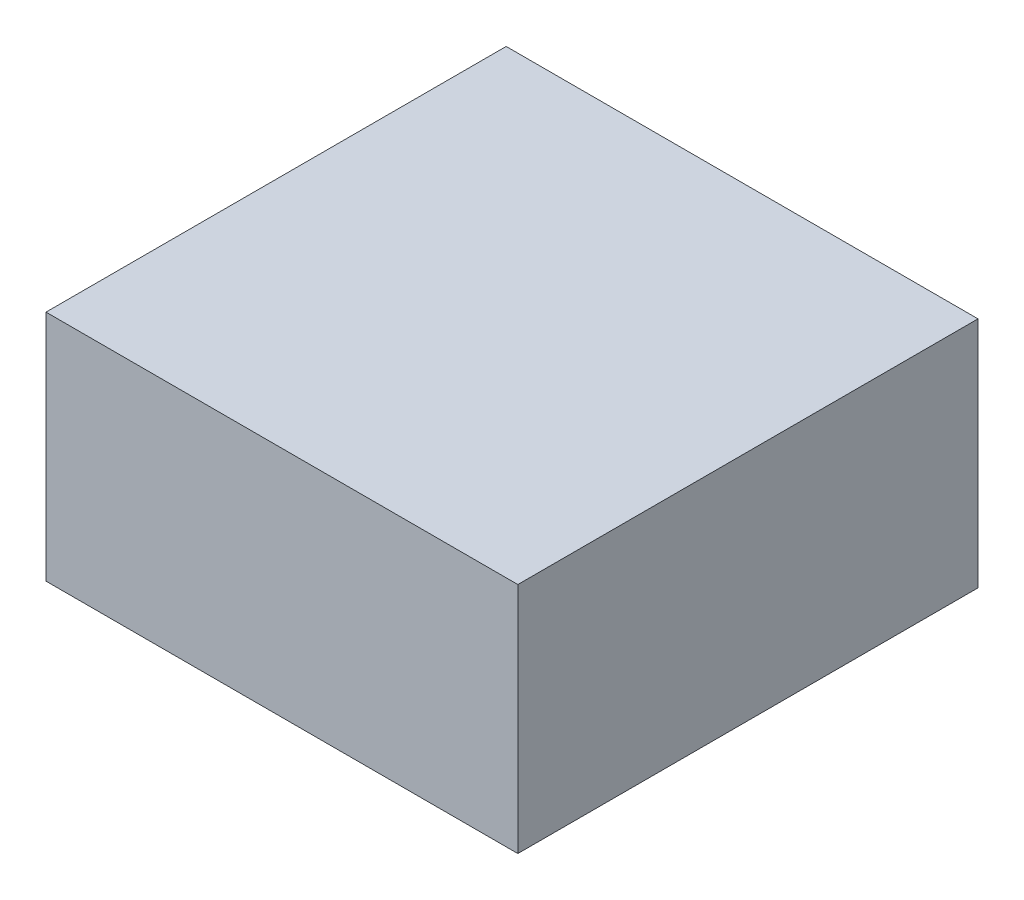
from build123d import *

# Parameters (mm, degrees)
SKETCH_1_W                        = 40.5
SKETCH_1_H                        = 20
MG995_SUPPLIER_40P5X20X39P5_DEPTH = 39.5


with BuildPart() as part:
    # Sketch 1 → MG995_SUPPLIER_40p5x20x39p5 (new body)
    with BuildSketch(Plane.XY):
        with Locations((10.25, 0)):
            Rectangle(SKETCH_1_W, SKETCH_1_H)
    extrude(amount=MG995_SUPPLIER_40P5X20X39P5_DEPTH)


solid = part.part
